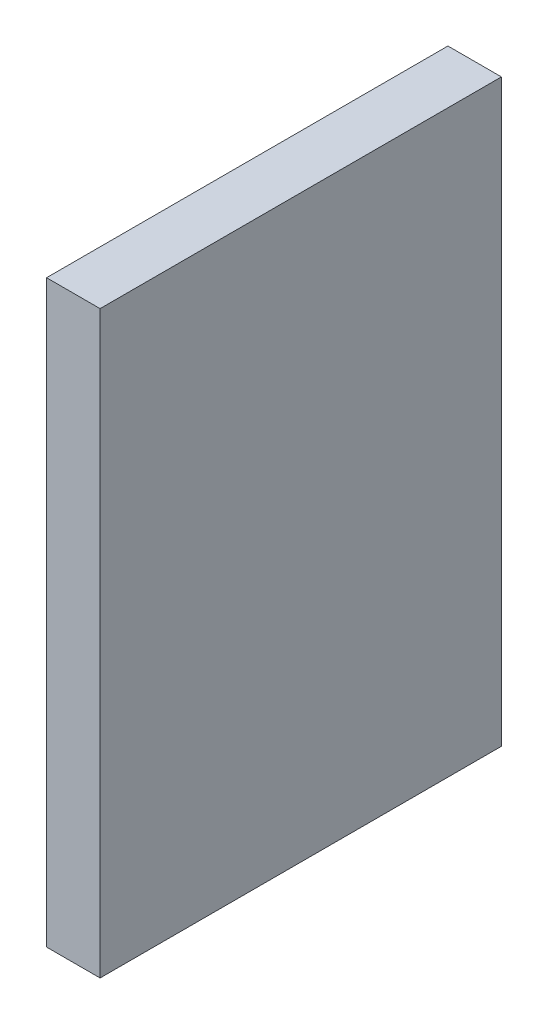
from build123d import *

# Parameters (mm, degrees)
ESQUISSE1_W      = 12
ESQUISSE1_H      = 130
EXTRUSION1_DEPTH = 90


with BuildPart() as part:
    # Esquisse1 → Extrusion1 (new body)
    with BuildSketch(Plane.XY):
        with Locations((6, 65)):
            Rectangle(ESQUISSE1_W, ESQUISSE1_H)
    extrude(amount=EXTRUSION1_DEPTH)


solid = part.part
